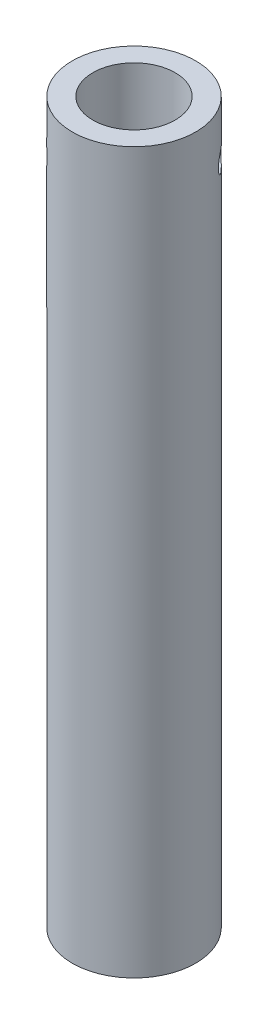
from build123d import *

# Parameters (mm, degrees)
SKETCH1_R                    = 3
BOSS_EXTRUDE3_DEPTH          = 35
SKETCH3_R                    = 2
CUT_EXTRUDE2_DEPTH           = 57.55
F_1_0_1_DIAMETER_HOLE3_D     = 1
F_1_0_1_DIAMETER_HOLE3_DEPTH = 9.91
F_1_0_1_DIAMETER_HOLE3_TIP   = 0.30043031


with BuildPart() as part:
    # Sketch1 → Boss-Extrude3 (new body)
    with BuildSketch(Plane(origin=(0, 0, 0), x_dir=(1, 0, 0), z_dir=(0, 1, 0))):
        with Locations(Location((0, 0, 0), (0, 0, 270))):
            Circle(SKETCH1_R)
    extrude(amount=BOSS_EXTRUDE3_DEPTH)

    # Sketch3 → Cut-Extrude2 (cut)
    with BuildSketch(Plane(origin=(0, 35, 0), x_dir=(1, 0, 0), z_dir=(0, 1, 0))):
        with Locations(Location((0, 0, 0), (0, 0, 270))):
            Circle(SKETCH3_R)
    extrude(amount=-CUT_EXTRUDE2_DEPTH, mode=Mode.SUBTRACT)

    # 1.0 _1_ Diameter Hole3
    with Locations(Plane(origin=(2.302914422, 32.5, -1.922650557), x_dir=(0.64088351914, 0, 0.767638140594), z_dir=(0.767638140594, 0, -0.64088351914))):
        with Locations((0, 0)):
            Hole(F_1_0_1_DIAMETER_HOLE3_D / 2, depth=F_1_0_1_DIAMETER_HOLE3_DEPTH)
            with Locations((0, 0, -(F_1_0_1_DIAMETER_HOLE3_DEPTH + F_1_0_1_DIAMETER_HOLE3_TIP / 2))):  # 118° drill point
                Cone(0, F_1_0_1_DIAMETER_HOLE3_D / 2, F_1_0_1_DIAMETER_HOLE3_TIP, mode=Mode.SUBTRACT)


solid = part.part
